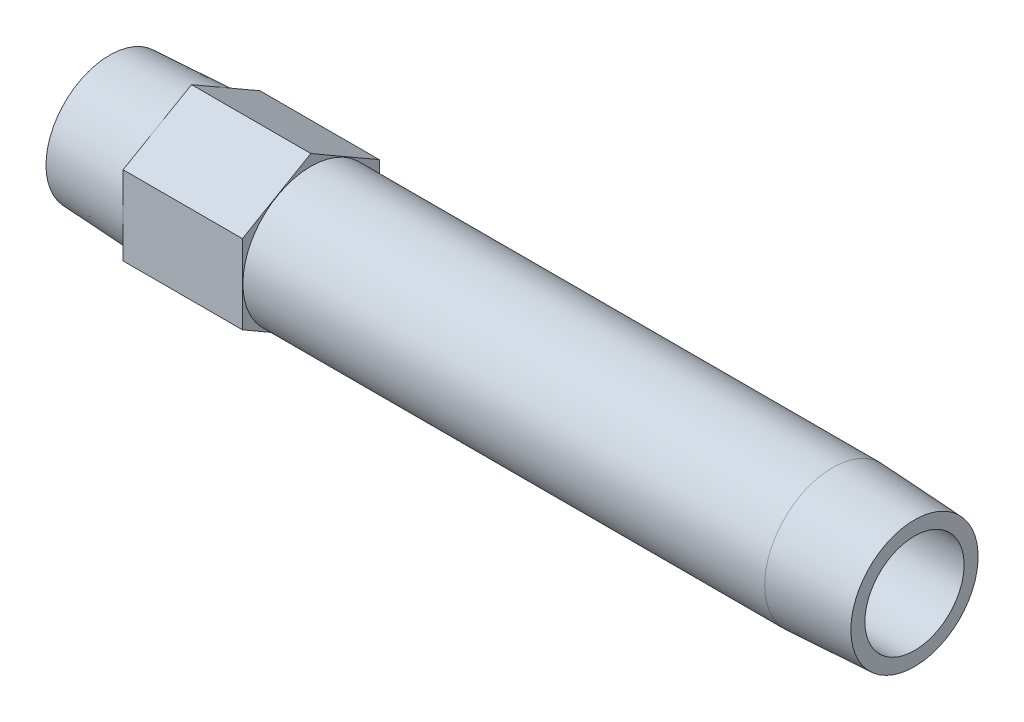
ISO-10303-21;
HEADER;
FILE_DESCRIPTION(('STEP AP214'),'2;1');
FILE_NAME('part.step','',(''),(''),'','','');
FILE_SCHEMA(('AUTOMOTIVE_DESIGN { 1 0 10303 214 1 1 1 1 }'));
ENDSEC;
DATA;
#1=APPLICATION_CONTEXT('core data for automotive mechanical design processes');
#2=APPLICATION_PROTOCOL_DEFINITION('international standard','automotive_design',2000,#1);
#3=PRODUCT_CONTEXT('',#1,'mechanical');
#4=PRODUCT('Part','Part','',(#3));
#5=PRODUCT_RELATED_PRODUCT_CATEGORY('part','',(#4));
#6=PRODUCT_DEFINITION_FORMATION('','',#4);
#7=PRODUCT_DEFINITION_CONTEXT('part definition',#1,'design');
#8=PRODUCT_DEFINITION('design','',#6,#7);
#9=PRODUCT_DEFINITION_SHAPE('','',#8);
#10=(LENGTH_UNIT() NAMED_UNIT(*) SI_UNIT(.MILLI.,.METRE.));
#11=(NAMED_UNIT(*) PLANE_ANGLE_UNIT() SI_UNIT($,.RADIAN.));
#12=(NAMED_UNIT(*) SI_UNIT($,.STERADIAN.) SOLID_ANGLE_UNIT());
#13=UNCERTAINTY_MEASURE_WITH_UNIT(LENGTH_MEASURE(1.E-05),#10,'distance_accuracy_value','');
#14=(GEOMETRIC_REPRESENTATION_CONTEXT(3) GLOBAL_UNCERTAINTY_ASSIGNED_CONTEXT((#13)) GLOBAL_UNIT_ASSIGNED_CONTEXT((#10,
#11,#12)) REPRESENTATION_CONTEXT('',''));
#15=CARTESIAN_POINT('',(0.,0.,0.));
#16=DIRECTION('',(0.,0.,1.));
#17=DIRECTION('',(1.,0.,0.));
#18=AXIS2_PLACEMENT_3D('',#15,#16,#17);
#19=CARTESIAN_POINT('',(0.,0.,-8.03071885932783));
#20=DIRECTION('',(1.,0.,0.));
#21=DIRECTION('',(0.,0.,-1.));
#22=AXIS2_PLACEMENT_3D('',#19,#20,#21);
#23=PLANE('',#22);
#24=CARTESIAN_POINT('',(0.,0.,0.));
#25=DIRECTION('',(-1.,0.,0.));
#26=DIRECTION('',(0.,0.,1.));
#27=AXIS2_PLACEMENT_3D('',#24,#25,#26);
#28=CIRCLE('',#27,8.03071885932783);
#29=CARTESIAN_POINT('',(0.,0.,8.03071885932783));
#30=VERTEX_POINT('',#29);
#31=EDGE_CURVE('E147',#30,#30,#28,.T.);
#32=ORIENTED_EDGE('',*,*,#31,.T.);
#33=EDGE_LOOP('',(#32));
#34=FACE_BOUND('',#33,.T.);
#35=CARTESIAN_POINT('',(0.,0.,0.));
#36=DIRECTION('',(1.,0.,0.));
#37=DIRECTION('',(0.,0.,1.));
#38=AXIS2_PLACEMENT_3D('',#35,#36,#37);
#39=CIRCLE('',#38,6.2611);
#40=CARTESIAN_POINT('',(0.,0.,6.2611));
#41=VERTEX_POINT('',#40);
#42=EDGE_CURVE('E159',#41,#41,#39,.T.);
#43=ORIENTED_EDGE('',*,*,#42,.T.);
#44=EDGE_LOOP('',(#43));
#45=FACE_BOUND('',#44,.T.);
#46=ADVANCED_FACE('F15',(#34,#45),#23,.F.);
#47=CARTESIAN_POINT('',(101.6,0.,-8.0307188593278));
#48=DIRECTION('',(-1.,0.,0.));
#49=DIRECTION('',(0.,0.,1.));
#50=AXIS2_PLACEMENT_3D('',#47,#48,#49);
#51=PLANE('',#50);
#52=CARTESIAN_POINT('',(101.6,0.,0.));
#53=DIRECTION('',(-1.,0.,0.));
#54=DIRECTION('',(0.,0.,1.));
#55=AXIS2_PLACEMENT_3D('',#52,#53,#54);
#56=CIRCLE('',#55,8.0307188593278);
#57=CARTESIAN_POINT('',(101.6,0.,8.0307188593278));
#58=VERTEX_POINT('',#57);
#59=EDGE_CURVE('E150',#58,#58,#56,.T.);
#60=ORIENTED_EDGE('',*,*,#59,.F.);
#61=EDGE_LOOP('',(#60));
#62=FACE_BOUND('',#61,.T.);
#63=CARTESIAN_POINT('',(101.6,0.,0.));
#64=DIRECTION('',(-1.,0.,0.));
#65=DIRECTION('',(0.,0.,1.));
#66=AXIS2_PLACEMENT_3D('',#63,#64,#65);
#67=CIRCLE('',#66,6.2611);
#68=CARTESIAN_POINT('',(101.6,0.,6.2611));
#69=VERTEX_POINT('',#68);
#70=EDGE_CURVE('E156',#69,#69,#67,.F.);
#71=ORIENTED_EDGE('',*,*,#70,.F.);
#72=EDGE_LOOP('',(#71));
#73=FACE_BOUND('',#72,.T.);
#74=ADVANCED_FACE('F178',(#62,#73),#51,.F.);
#75=CARTESIAN_POINT('',(25.4,-4.9859969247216,-8.636));
#76=DIRECTION('',(1.,0.,0.));
#77=DIRECTION('',(0.,1.,0.));
#78=AXIS2_PLACEMENT_3D('',#75,#76,#77);
#79=PLANE('',#78);
#80=DIRECTION('',(0.,0.5,-0.866025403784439));
#81=VECTOR('',#80,1.);
#82=CARTESIAN_POINT('',(25.4,-9.97199384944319,0.));
#83=LINE('',#82,#81);
#84=CARTESIAN_POINT('',(25.4,-9.97199384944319,0.));
#85=VERTEX_POINT('',#84);
#86=CARTESIAN_POINT('',(25.4,-4.9859969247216,-8.636));
#87=VERTEX_POINT('',#86);
#88=EDGE_CURVE('E103',#85,#87,#83,.T.);
#89=ORIENTED_EDGE('',*,*,#88,.T.);
#90=DIRECTION('',(0.,1.,0.));
#91=VECTOR('',#90,1.);
#92=CARTESIAN_POINT('',(25.4,-4.9859969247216,-8.636));
#93=LINE('',#92,#91);
#94=CARTESIAN_POINT('',(25.4,4.9859969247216,-8.636));
#95=VERTEX_POINT('',#94);
#96=EDGE_CURVE('E83',#87,#95,#93,.T.);
#97=ORIENTED_EDGE('',*,*,#96,.T.);
#98=DIRECTION('',(0.,0.5,0.866025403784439));
#99=VECTOR('',#98,1.);
#100=CARTESIAN_POINT('',(25.4,4.9859969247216,-8.636));
#101=LINE('',#100,#99);
#102=CARTESIAN_POINT('',(25.4,9.97199384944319,0.));
#103=VERTEX_POINT('',#102);
#104=EDGE_CURVE('E102',#95,#103,#101,.T.);
#105=ORIENTED_EDGE('',*,*,#104,.T.);
#106=DIRECTION('',(0.,-0.5,0.866025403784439));
#107=VECTOR('',#106,1.);
#108=CARTESIAN_POINT('',(25.4,9.97199384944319,0.));
#109=LINE('',#108,#107);
#110=CARTESIAN_POINT('',(25.4,4.9859969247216,8.636));
#111=VERTEX_POINT('',#110);
#112=EDGE_CURVE('E105',#103,#111,#109,.T.);
#113=ORIENTED_EDGE('',*,*,#112,.T.);
#114=DIRECTION('',(0.,-1.,0.));
#115=VECTOR('',#114,1.);
#116=CARTESIAN_POINT('',(25.4,4.9859969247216,8.636));
#117=LINE('',#116,#115);
#118=CARTESIAN_POINT('',(25.4,-4.9859969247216,8.636));
#119=VERTEX_POINT('',#118);
#120=EDGE_CURVE('E35',#111,#119,#117,.T.);
#121=ORIENTED_EDGE('',*,*,#120,.T.);
#122=DIRECTION('',(0.,-0.5,-0.866025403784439));
#123=VECTOR('',#122,1.);
#124=CARTESIAN_POINT('',(25.4,-4.9859969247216,8.636));
#125=LINE('',#124,#123);
#126=EDGE_CURVE('E30',#119,#85,#125,.T.);
#127=ORIENTED_EDGE('',*,*,#126,.T.);
#128=EDGE_LOOP('',(#89,#97,#105,#113,#121,#127));
#129=FACE_BOUND('',#128,.T.);
#130=CARTESIAN_POINT('',(25.4,0.,0.));
#131=DIRECTION('',(1.,0.,0.));
#132=DIRECTION('',(0.,1.,0.));
#133=AXIS2_PLACEMENT_3D('',#130,#131,#132);
#134=CIRCLE('',#133,8.5725);
#135=CARTESIAN_POINT('',(25.4,8.5725,0.));
#136=VERTEX_POINT('',#135);
#137=EDGE_CURVE('E89',#136,#136,#134,.F.);
#138=ORIENTED_EDGE('',*,*,#137,.T.);
#139=EDGE_LOOP('',(#138));
#140=FACE_BOUND('',#139,.T.);
#141=ADVANCED_FACE('F124',(#129,#140),#79,.T.);
#142=CARTESIAN_POINT('',(10.3378,-4.9859969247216,-8.636));
#143=DIRECTION('',(1.,0.,0.));
#144=DIRECTION('',(0.,1.,0.));
#145=AXIS2_PLACEMENT_3D('',#142,#143,#144);
#146=PLANE('',#145);
#147=DIRECTION('',(0.,0.5,-0.866025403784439));
#148=VECTOR('',#147,1.);
#149=CARTESIAN_POINT('',(10.3378,-9.97199384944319,0.));
#150=LINE('',#149,#148);
#151=CARTESIAN_POINT('',(10.3378,-9.97199384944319,0.));
#152=VERTEX_POINT('',#151);
#153=CARTESIAN_POINT('',(10.3378,-4.9859969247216,-8.636));
#154=VERTEX_POINT('',#153);
#155=EDGE_CURVE('E73',#152,#154,#150,.T.);
#156=ORIENTED_EDGE('',*,*,#155,.F.);
#157=DIRECTION('',(0.,-0.5,-0.866025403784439));
#158=VECTOR('',#157,1.);
#159=CARTESIAN_POINT('',(10.3378,-4.9859969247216,8.636));
#160=LINE('',#159,#158);
#161=CARTESIAN_POINT('',(10.3378,-4.9859969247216,8.636));
#162=VERTEX_POINT('',#161);
#163=EDGE_CURVE('E99',#162,#152,#160,.T.);
#164=ORIENTED_EDGE('',*,*,#163,.F.);
#165=DIRECTION('',(0.,-1.,0.));
#166=VECTOR('',#165,1.);
#167=CARTESIAN_POINT('',(10.3378,4.9859969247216,8.636));
#168=LINE('',#167,#166);
#169=CARTESIAN_POINT('',(10.3378,4.9859969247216,8.636));
#170=VERTEX_POINT('',#169);
#171=EDGE_CURVE('E133',#170,#162,#168,.T.);
#172=ORIENTED_EDGE('',*,*,#171,.F.);
#173=DIRECTION('',(0.,-0.5,0.866025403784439));
#174=VECTOR('',#173,1.);
#175=CARTESIAN_POINT('',(10.3378,9.97199384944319,0.));
#176=LINE('',#175,#174);
#177=CARTESIAN_POINT('',(10.3378,9.97199384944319,0.));
#178=VERTEX_POINT('',#177);
#179=EDGE_CURVE('E129',#178,#170,#176,.T.);
#180=ORIENTED_EDGE('',*,*,#179,.F.);
#181=DIRECTION('',(0.,0.5,0.866025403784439));
#182=VECTOR('',#181,1.);
#183=CARTESIAN_POINT('',(10.3378,4.9859969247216,-8.636));
#184=LINE('',#183,#182);
#185=CARTESIAN_POINT('',(10.3378,4.9859969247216,-8.636));
#186=VERTEX_POINT('',#185);
#187=EDGE_CURVE('E75',#186,#178,#184,.T.);
#188=ORIENTED_EDGE('',*,*,#187,.F.);
#189=DIRECTION('',(0.,1.,0.));
#190=VECTOR('',#189,1.);
#191=CARTESIAN_POINT('',(10.3378,-4.9859969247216,-8.636));
#192=LINE('',#191,#190);
#193=EDGE_CURVE('E68',#154,#186,#192,.T.);
#194=ORIENTED_EDGE('',*,*,#193,.F.);
#195=EDGE_LOOP('',(#156,#164,#172,#180,#188,#194));
#196=FACE_BOUND('',#195,.T.);
#197=CARTESIAN_POINT('',(10.3378,0.,0.));
#198=DIRECTION('',(-1.,0.,0.));
#199=DIRECTION('',(0.,0.,1.));
#200=AXIS2_PLACEMENT_3D('',#197,#198,#199);
#201=CIRCLE('',#200,8.5725);
#202=CARTESIAN_POINT('',(10.3378,0.,8.5725));
#203=VERTEX_POINT('',#202);
#204=EDGE_CURVE('E95',#203,#203,#201,.T.);
#205=ORIENTED_EDGE('',*,*,#204,.F.);
#206=EDGE_LOOP('',(#205));
#207=FACE_BOUND('',#206,.T.);
#208=ADVANCED_FACE('F69',(#196,#207),#146,.F.);
#209=CARTESIAN_POINT('',(25.4,-9.97199384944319,0.));
#210=DIRECTION('',(0.,0.866025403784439,0.5));
#211=DIRECTION('',(0.,-0.5,0.866025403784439));
#212=AXIS2_PLACEMENT_3D('',#209,#210,#211);
#213=PLANE('',#212);
#214=ORIENTED_EDGE('',*,*,#155,.T.);
#215=DIRECTION('',(-1.,0.,0.));
#216=VECTOR('',#215,1.);
#217=CARTESIAN_POINT('',(25.4,-4.9859969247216,-8.636));
#218=LINE('',#217,#216);
#219=EDGE_CURVE('E10',#87,#154,#218,.T.);
#220=ORIENTED_EDGE('',*,*,#219,.F.);
#221=ORIENTED_EDGE('',*,*,#88,.F.);
#222=DIRECTION('',(-1.,0.,0.));
#223=VECTOR('',#222,1.);
#224=CARTESIAN_POINT('',(25.4,-9.97199384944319,0.));
#225=LINE('',#224,#223);
#226=EDGE_CURVE('E87',#85,#152,#225,.T.);
#227=ORIENTED_EDGE('',*,*,#226,.T.);
#228=EDGE_LOOP('',(#214,#220,#221,#227));
#229=FACE_BOUND('',#228,.T.);
#230=ADVANCED_FACE('F17',(#229),#213,.F.);
#231=CARTESIAN_POINT('',(25.4,-4.9859969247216,-8.636));
#232=DIRECTION('',(0.,0.,1.));
#233=DIRECTION('',(1.,0.,0.));
#234=AXIS2_PLACEMENT_3D('',#231,#232,#233);
#235=PLANE('',#234);
#236=ORIENTED_EDGE('',*,*,#193,.T.);
#237=DIRECTION('',(-1.,0.,0.));
#238=VECTOR('',#237,1.);
#239=CARTESIAN_POINT('',(25.4,4.9859969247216,-8.636));
#240=LINE('',#239,#238);
#241=EDGE_CURVE('E23',#95,#186,#240,.T.);
#242=ORIENTED_EDGE('',*,*,#241,.F.);
#243=ORIENTED_EDGE('',*,*,#96,.F.);
#244=ORIENTED_EDGE('',*,*,#219,.T.);
#245=EDGE_LOOP('',(#236,#242,#243,#244));
#246=FACE_BOUND('',#245,.T.);
#247=ADVANCED_FACE('F82',(#246),#235,.F.);
#248=CARTESIAN_POINT('',(25.4,4.9859969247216,-8.636));
#249=DIRECTION('',(0.,-0.866025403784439,0.5));
#250=DIRECTION('',(0.,-0.5,-0.866025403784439));
#251=AXIS2_PLACEMENT_3D('',#248,#249,#250);
#252=PLANE('',#251);
#253=ORIENTED_EDGE('',*,*,#187,.T.);
#254=DIRECTION('',(-1.,0.,0.));
#255=VECTOR('',#254,1.);
#256=CARTESIAN_POINT('',(25.4,9.97199384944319,0.));
#257=LINE('',#256,#255);
#258=EDGE_CURVE('E117',#103,#178,#257,.T.);
#259=ORIENTED_EDGE('',*,*,#258,.F.);
#260=ORIENTED_EDGE('',*,*,#104,.F.);
#261=ORIENTED_EDGE('',*,*,#241,.T.);
#262=EDGE_LOOP('',(#253,#259,#260,#261));
#263=FACE_BOUND('',#262,.T.);
#264=ADVANCED_FACE('F121',(#263),#252,.F.);
#265=CARTESIAN_POINT('',(25.4,9.97199384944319,0.));
#266=DIRECTION('',(0.,-0.866025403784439,-0.5));
#267=DIRECTION('',(0.,0.5,-0.866025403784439));
#268=AXIS2_PLACEMENT_3D('',#265,#266,#267);
#269=PLANE('',#268);
#270=ORIENTED_EDGE('',*,*,#179,.T.);
#271=DIRECTION('',(-1.,0.,0.));
#272=VECTOR('',#271,1.);
#273=CARTESIAN_POINT('',(25.4,4.9859969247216,8.636));
#274=LINE('',#273,#272);
#275=EDGE_CURVE('E114',#111,#170,#274,.T.);
#276=ORIENTED_EDGE('',*,*,#275,.F.);
#277=ORIENTED_EDGE('',*,*,#112,.F.);
#278=ORIENTED_EDGE('',*,*,#258,.T.);
#279=EDGE_LOOP('',(#270,#276,#277,#278));
#280=FACE_BOUND('',#279,.T.);
#281=ADVANCED_FACE('F128',(#280),#269,.F.);
#282=CARTESIAN_POINT('',(25.4,4.9859969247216,8.636));
#283=DIRECTION('',(0.,0.,-1.));
#284=DIRECTION('',(-1.,0.,0.));
#285=AXIS2_PLACEMENT_3D('',#282,#283,#284);
#286=PLANE('',#285);
#287=ORIENTED_EDGE('',*,*,#171,.T.);
#288=DIRECTION('',(-1.,0.,0.));
#289=VECTOR('',#288,1.);
#290=CARTESIAN_POINT('',(25.4,-4.9859969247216,8.636));
#291=LINE('',#290,#289);
#292=EDGE_CURVE('E111',#119,#162,#291,.T.);
#293=ORIENTED_EDGE('',*,*,#292,.F.);
#294=ORIENTED_EDGE('',*,*,#120,.F.);
#295=ORIENTED_EDGE('',*,*,#275,.T.);
#296=EDGE_LOOP('',(#287,#293,#294,#295));
#297=FACE_BOUND('',#296,.T.);
#298=ADVANCED_FACE('F132',(#297),#286,.F.);
#299=CARTESIAN_POINT('',(25.4,-4.9859969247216,8.636));
#300=DIRECTION('',(0.,0.866025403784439,-0.5));
#301=DIRECTION('',(0.,0.5,0.866025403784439));
#302=AXIS2_PLACEMENT_3D('',#299,#300,#301);
#303=PLANE('',#302);
#304=ORIENTED_EDGE('',*,*,#163,.T.);
#305=ORIENTED_EDGE('',*,*,#226,.F.);
#306=ORIENTED_EDGE('',*,*,#126,.F.);
#307=ORIENTED_EDGE('',*,*,#292,.T.);
#308=EDGE_LOOP('',(#304,#305,#306,#307));
#309=FACE_BOUND('',#308,.T.);
#310=ADVANCED_FACE('F135',(#309),#303,.F.);
#311=CARTESIAN_POINT('',(10.3378,0.,0.));
#312=DIRECTION('',(1.,0.,0.));
#313=DIRECTION('',(0.,0.,-1.));
#314=AXIS2_PLACEMENT_3D('',#311,#312,#313);
#315=CONICAL_SURFACE('',#314,8.5725,0.0523598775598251);
#316=ORIENTED_EDGE('',*,*,#31,.F.);
#317=EDGE_LOOP('',(#316));
#318=FACE_BOUND('',#317,.T.);
#319=ORIENTED_EDGE('',*,*,#204,.T.);
#320=EDGE_LOOP('',(#319));
#321=FACE_BOUND('',#320,.T.);
#322=ADVANCED_FACE('F187',(#318,#321),#315,.T.);
#323=CARTESIAN_POINT('',(-60.,0.,0.));
#324=DIRECTION('',(-1.,0.,0.));
#325=DIRECTION('',(0.,0.,1.));
#326=AXIS2_PLACEMENT_3D('',#323,#324,#325);
#327=CYLINDRICAL_SURFACE('',#326,8.5725);
#328=ORIENTED_EDGE('',*,*,#137,.F.);
#329=EDGE_LOOP('',(#328));
#330=FACE_BOUND('',#329,.T.);
#331=CARTESIAN_POINT('',(91.2622,0.,0.));
#332=DIRECTION('',(-1.,0.,0.));
#333=DIRECTION('',(0.,0.,1.));
#334=AXIS2_PLACEMENT_3D('',#331,#332,#333);
#335=CIRCLE('',#334,8.5725);
#336=CARTESIAN_POINT('',(91.2622,0.,8.5725));
#337=VERTEX_POINT('',#336);
#338=EDGE_CURVE('E153',#337,#337,#335,.T.);
#339=ORIENTED_EDGE('',*,*,#338,.T.);
#340=EDGE_LOOP('',(#339));
#341=FACE_BOUND('',#340,.T.);
#342=ADVANCED_FACE('F174',(#330,#341),#327,.T.);
#343=CARTESIAN_POINT('',(101.6,0.,0.));
#344=DIRECTION('',(-1.,0.,0.));
#345=DIRECTION('',(0.,0.,1.));
#346=AXIS2_PLACEMENT_3D('',#343,#344,#345);
#347=CONICAL_SURFACE('',#346,8.0307188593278,0.0523598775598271);
#348=ORIENTED_EDGE('',*,*,#338,.F.);
#349=EDGE_LOOP('',(#348));
#350=FACE_BOUND('',#349,.T.);
#351=ORIENTED_EDGE('',*,*,#59,.T.);
#352=EDGE_LOOP('',(#351));
#353=FACE_BOUND('',#352,.T.);
#354=ADVANCED_FACE('F167',(#350,#353),#347,.T.);
#355=CARTESIAN_POINT('',(104.969731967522,0.,0.));
#356=DIRECTION('',(-1.,0.,0.));
#357=DIRECTION('',(0.,0.,1.));
#358=AXIS2_PLACEMENT_3D('',#355,#356,#357);
#359=CYLINDRICAL_SURFACE('',#358,6.2611);
#360=ORIENTED_EDGE('',*,*,#70,.T.);
#361=EDGE_LOOP('',(#360));
#362=FACE_BOUND('',#361,.T.);
#363=ORIENTED_EDGE('',*,*,#42,.F.);
#364=EDGE_LOOP('',(#363));
#365=FACE_BOUND('',#364,.T.);
#366=ADVANCED_FACE('F165',(#362,#365),#359,.F.);
#367=CLOSED_SHELL('',(#46,#74,#141,#208,#230,#247,#264,#281,#298,#310,#322,#342,#354,#366));
#368=MANIFOLD_SOLID_BREP('B1',#367);
#369=ADVANCED_BREP_SHAPE_REPRESENTATION('',(#18,#368),#14);
#370=SHAPE_DEFINITION_REPRESENTATION(#9,#369);
ENDSEC;
END-ISO-10303-21;
